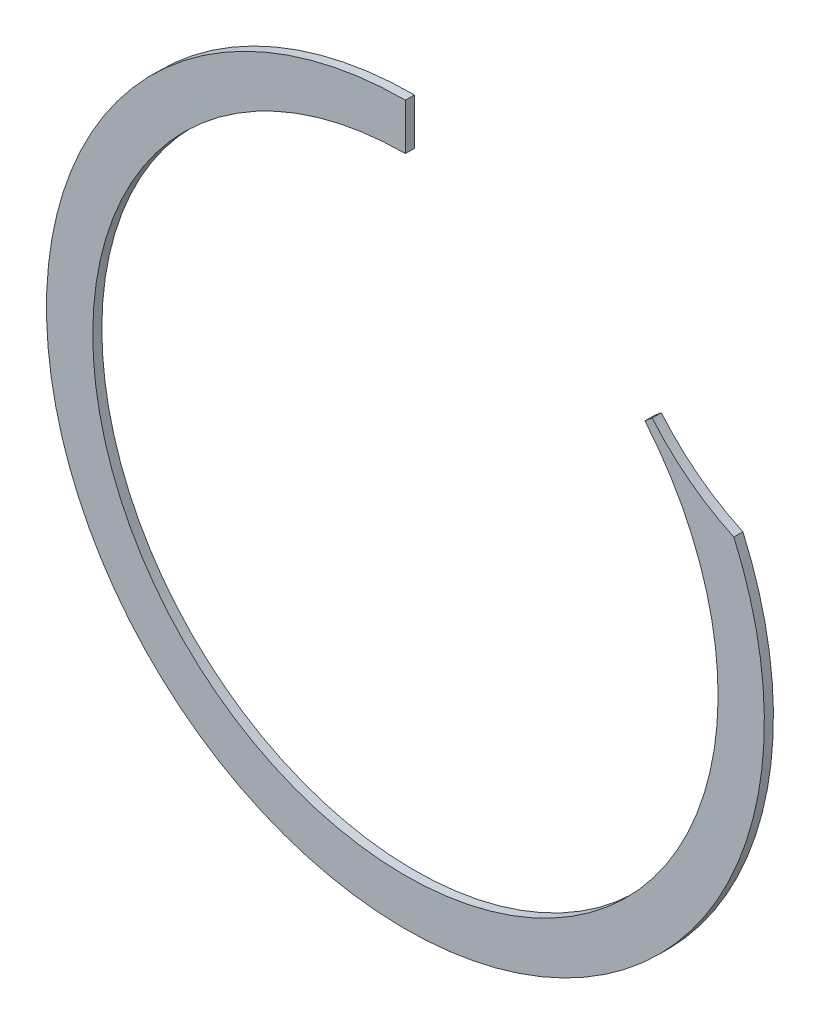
from build123d import *

# Parameters (mm, degrees)
SKETCH1_R          = 31.1277
SKETCH1_R_2        = 27.1145
EXTRUDE1_DEPTH     = 0.7874
CUT_EXTRUDE1_DEPTH = 45.028256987


with BuildPart() as part:
    # Sketch1 → Extrude1 (new body)
    with BuildSketch(Plane.XY):
        Circle(SKETCH1_R)
        Circle(SKETCH1_R_2, mode=Mode.SUBTRACT)
    extrude(amount=EXTRUDE1_DEPTH)

    # Sketch2 → Cut-Extrude1 (cut, through all)
    with BuildSketch(Plane.XY):
        with BuildLine():
            Line((21.403281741, 17.959485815), (0, 0))
            Line((0, 0), (0, 31.1277))
            Line((0, 31.1277), (16.649585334, 31.1277))
            ThreePointArc((16.649585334, 31.1277), (56.082051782, 37.920589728), (21.403281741, 17.959485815))
        make_face()
    extrude(amount=CUT_EXTRUDE1_DEPTH, mode=Mode.SUBTRACT)


solid = part.part
